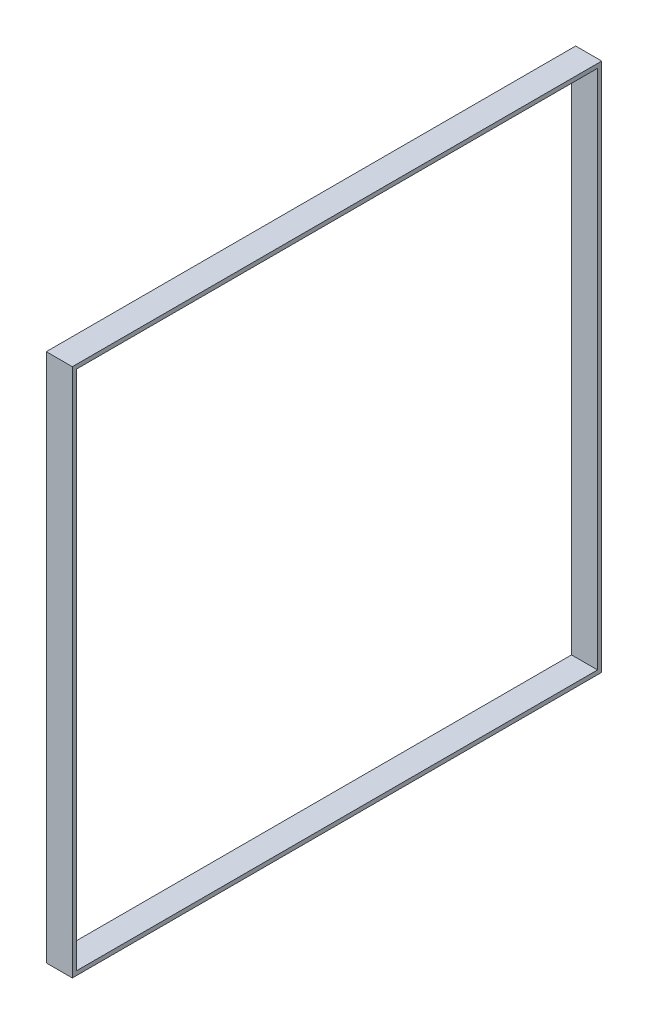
from build123d import *

# Parameters (mm, degrees)
SKETCH1_W            = 304.8
SKETCH1_H            = 304.8
SKETCH1_W_2          = 300
SKETCH1_H_2          = 300
PERIMETER_SEAL_DEPTH = 15


with BuildPart() as part:
    # Sketch1 → Perimeter_seal (new body)
    with BuildSketch(Plane.YZ):
        Rectangle(SKETCH1_W, SKETCH1_H)
        Rectangle(SKETCH1_W_2, SKETCH1_H_2, mode=Mode.SUBTRACT)
    extrude(amount=PERIMETER_SEAL_DEPTH)


solid = part.part
